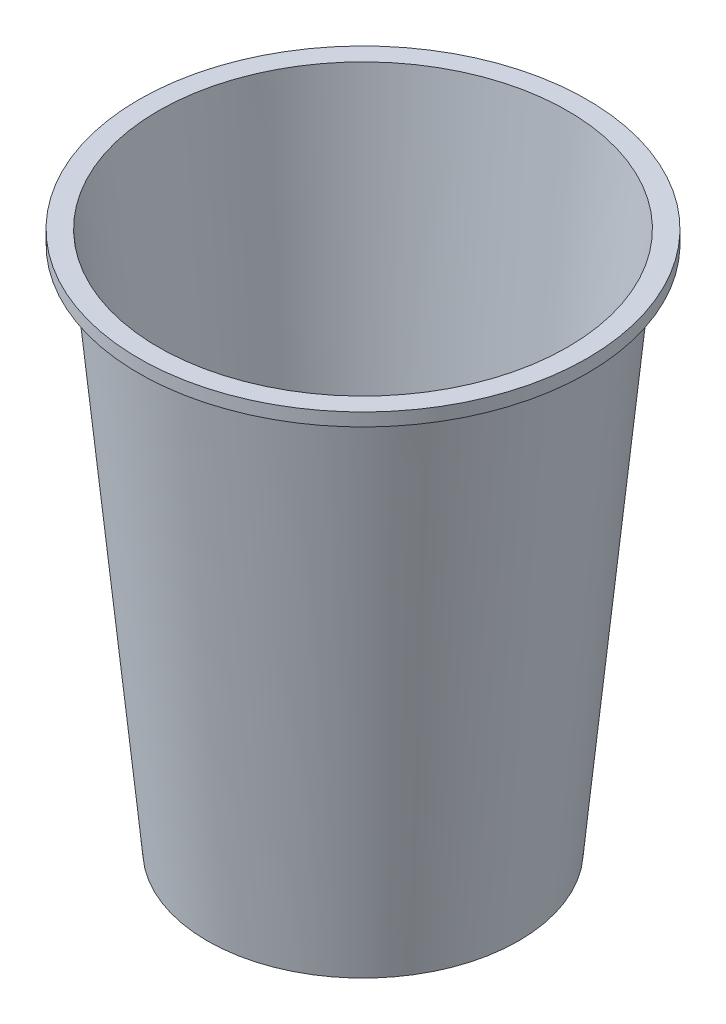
ISO-10303-21;
HEADER;
FILE_DESCRIPTION(('STEP AP214'),'2;1');
FILE_NAME('part.step','',(''),(''),'','','');
FILE_SCHEMA(('AUTOMOTIVE_DESIGN { 1 0 10303 214 1 1 1 1 }'));
ENDSEC;
DATA;
#1=APPLICATION_CONTEXT('core data for automotive mechanical design processes');
#2=APPLICATION_PROTOCOL_DEFINITION('international standard','automotive_design',2000,#1);
#3=PRODUCT_CONTEXT('',#1,'mechanical');
#4=PRODUCT('Part','Part','',(#3));
#5=PRODUCT_RELATED_PRODUCT_CATEGORY('part','',(#4));
#6=PRODUCT_DEFINITION_FORMATION('','',#4);
#7=PRODUCT_DEFINITION_CONTEXT('part definition',#1,'design');
#8=PRODUCT_DEFINITION('design','',#6,#7);
#9=PRODUCT_DEFINITION_SHAPE('','',#8);
#10=(LENGTH_UNIT() NAMED_UNIT(*) SI_UNIT(.MILLI.,.METRE.));
#11=(NAMED_UNIT(*) PLANE_ANGLE_UNIT() SI_UNIT($,.RADIAN.));
#12=(NAMED_UNIT(*) SI_UNIT($,.STERADIAN.) SOLID_ANGLE_UNIT());
#13=UNCERTAINTY_MEASURE_WITH_UNIT(LENGTH_MEASURE(1.E-05),#10,'distance_accuracy_value','');
#14=(GEOMETRIC_REPRESENTATION_CONTEXT(3) GLOBAL_UNCERTAINTY_ASSIGNED_CONTEXT((#13)) GLOBAL_UNIT_ASSIGNED_CONTEXT((#10,
#11,#12)) REPRESENTATION_CONTEXT('',''));
#15=CARTESIAN_POINT('',(0.,0.,0.));
#16=DIRECTION('',(0.,0.,1.));
#17=DIRECTION('',(1.,0.,0.));
#18=AXIS2_PLACEMENT_3D('',#15,#16,#17);
#19=CARTESIAN_POINT('',(24.,-83.,0.));
#20=DIRECTION('',(0.,1.,0.));
#21=DIRECTION('',(-1.,0.,0.));
#22=AXIS2_PLACEMENT_3D('',#19,#20,#21);
#23=PLANE('',#22);
#24=CARTESIAN_POINT('',(0.,-83.,0.));
#25=DIRECTION('',(0.,1.,0.));
#26=DIRECTION('',(-1.,0.,0.));
#27=AXIS2_PLACEMENT_3D('',#24,#25,#26);
#28=CIRCLE('',#27,24.);
#29=CARTESIAN_POINT('',(-24.,-83.,0.));
#30=VERTEX_POINT('',#29);
#31=EDGE_CURVE('E10',#30,#30,#28,.T.);
#32=ORIENTED_EDGE('',*,*,#31,.F.);
#33=EDGE_LOOP('',(#32));
#34=FACE_BOUND('',#33,.T.);
#35=ADVANCED_FACE('F35',(#34),#23,.F.);
#36=CARTESIAN_POINT('',(0.,-83.,0.));
#37=DIRECTION('',(0.,1.,0.));
#38=DIRECTION('',(-1.,0.,0.));
#39=AXIS2_PLACEMENT_3D('',#36,#37,#38);
#40=CONICAL_SURFACE('',#39,24.,0.0953886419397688);
#41=CARTESIAN_POINT('',(0.,-2.00000000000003,0.));
#42=DIRECTION('',(0.,1.,0.));
#43=DIRECTION('',(-1.,0.,0.));
#44=AXIS2_PLACEMENT_3D('',#41,#42,#43);
#45=CIRCLE('',#44,31.75);
#46=CARTESIAN_POINT('',(-31.75,-2.00000000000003,0.));
#47=VERTEX_POINT('',#46);
#48=EDGE_CURVE('E41',#47,#47,#45,.T.);
#49=ORIENTED_EDGE('',*,*,#48,.F.);
#50=EDGE_LOOP('',(#49));
#51=FACE_BOUND('',#50,.T.);
#52=ORIENTED_EDGE('',*,*,#31,.T.);
#53=EDGE_LOOP('',(#52));
#54=FACE_BOUND('',#53,.T.);
#55=ADVANCED_FACE('F83',(#51,#54),#40,.T.);
#56=CARTESIAN_POINT('',(31.75,-2.00000000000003,0.));
#57=DIRECTION('',(0.,1.,0.));
#58=DIRECTION('',(-1.,0.,0.));
#59=AXIS2_PLACEMENT_3D('',#56,#57,#58);
#60=PLANE('',#59);
#61=CARTESIAN_POINT('',(0.,-2.00000000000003,0.));
#62=DIRECTION('',(0.,1.,0.));
#63=DIRECTION('',(-1.,0.,0.));
#64=AXIS2_PLACEMENT_3D('',#61,#62,#63);
#65=CIRCLE('',#64,34.5395313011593);
#66=CARTESIAN_POINT('',(-34.5395313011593,-2.00000000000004,0.));
#67=VERTEX_POINT('',#66);
#68=EDGE_CURVE('E45',#67,#67,#65,.T.);
#69=ORIENTED_EDGE('',*,*,#68,.F.);
#70=EDGE_LOOP('',(#69));
#71=FACE_BOUND('',#70,.T.);
#72=ORIENTED_EDGE('',*,*,#48,.T.);
#73=EDGE_LOOP('',(#72));
#74=FACE_BOUND('',#73,.T.);
#75=ADVANCED_FACE('F78',(#71,#74),#60,.F.);
#76=CARTESIAN_POINT('',(0.,0.,0.));
#77=DIRECTION('',(0.,1.,0.));
#78=DIRECTION('',(-1.,0.,0.));
#79=AXIS2_PLACEMENT_3D('',#76,#77,#78);
#80=CYLINDRICAL_SURFACE('',#79,34.5395313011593);
#81=CARTESIAN_POINT('',(0.,0.,0.));
#82=DIRECTION('',(0.,1.,0.));
#83=DIRECTION('',(-1.,0.,0.));
#84=AXIS2_PLACEMENT_3D('',#81,#82,#83);
#85=CIRCLE('',#84,34.5395313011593);
#86=CARTESIAN_POINT('',(-34.5395313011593,0.,0.));
#87=VERTEX_POINT('',#86);
#88=EDGE_CURVE('E49',#87,#87,#85,.T.);
#89=ORIENTED_EDGE('',*,*,#88,.F.);
#90=EDGE_LOOP('',(#89));
#91=FACE_BOUND('',#90,.T.);
#92=ORIENTED_EDGE('',*,*,#68,.T.);
#93=EDGE_LOOP('',(#92));
#94=FACE_BOUND('',#93,.T.);
#95=ADVANCED_FACE('F72',(#91,#94),#80,.T.);
#96=CARTESIAN_POINT('',(31.5395313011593,0.,0.));
#97=DIRECTION('',(0.,-1.,0.));
#98=DIRECTION('',(1.,0.,0.));
#99=AXIS2_PLACEMENT_3D('',#96,#97,#98);
#100=PLANE('',#99);
#101=CARTESIAN_POINT('',(0.,0.,0.));
#102=DIRECTION('',(0.,1.,0.));
#103=DIRECTION('',(-1.,0.,0.));
#104=AXIS2_PLACEMENT_3D('',#101,#102,#103);
#105=CIRCLE('',#104,31.5395313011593);
#106=CARTESIAN_POINT('',(-31.5395313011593,0.,0.));
#107=VERTEX_POINT('',#106);
#108=EDGE_CURVE('E54',#107,#107,#105,.T.);
#109=ORIENTED_EDGE('',*,*,#108,.F.);
#110=EDGE_LOOP('',(#109));
#111=FACE_BOUND('',#110,.T.);
#112=ORIENTED_EDGE('',*,*,#88,.T.);
#113=EDGE_LOOP('',(#112));
#114=FACE_BOUND('',#113,.T.);
#115=ADVANCED_FACE('F66',(#111,#114),#100,.F.);
#116=CARTESIAN_POINT('',(0.,0.,0.));
#117=DIRECTION('',(0.,1.,0.));
#118=DIRECTION('',(-1.,0.,0.));
#119=AXIS2_PLACEMENT_3D('',#116,#117,#118);
#120=CONICAL_SURFACE('',#119,31.5395313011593,0.095388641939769);
#121=CARTESIAN_POINT('',(0.,-82.6,0.));
#122=DIRECTION('',(0.,1.,0.));
#123=DIRECTION('',(-1.,0.,0.));
#124=AXIS2_PLACEMENT_3D('',#121,#122,#123);
#125=CIRCLE('',#124,23.6364448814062);
#126=CARTESIAN_POINT('',(-23.6364448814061,-82.6,0.));
#127=VERTEX_POINT('',#126);
#128=EDGE_CURVE('E57',#127,#127,#125,.T.);
#129=ORIENTED_EDGE('',*,*,#128,.F.);
#130=EDGE_LOOP('',(#129));
#131=FACE_BOUND('',#130,.T.);
#132=ORIENTED_EDGE('',*,*,#108,.T.);
#133=EDGE_LOOP('',(#132));
#134=FACE_BOUND('',#133,.T.);
#135=ADVANCED_FACE('F63',(#131,#134),#120,.F.);
#136=CARTESIAN_POINT('',(23.6364448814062,-82.6,0.));
#137=DIRECTION('',(0.,-1.,0.));
#138=DIRECTION('',(1.,0.,0.));
#139=AXIS2_PLACEMENT_3D('',#136,#137,#138);
#140=PLANE('',#139);
#141=ORIENTED_EDGE('',*,*,#128,.T.);
#142=EDGE_LOOP('',(#141));
#143=FACE_BOUND('',#142,.T.);
#144=ADVANCED_FACE('F61',(#143),#140,.F.);
#145=CLOSED_SHELL('',(#35,#55,#75,#95,#115,#135,#144));
#146=MANIFOLD_SOLID_BREP('B2',#145);
#147=ADVANCED_BREP_SHAPE_REPRESENTATION('',(#18,#146),#14);
#148=SHAPE_DEFINITION_REPRESENTATION(#9,#147);
ENDSEC;
END-ISO-10303-21;
